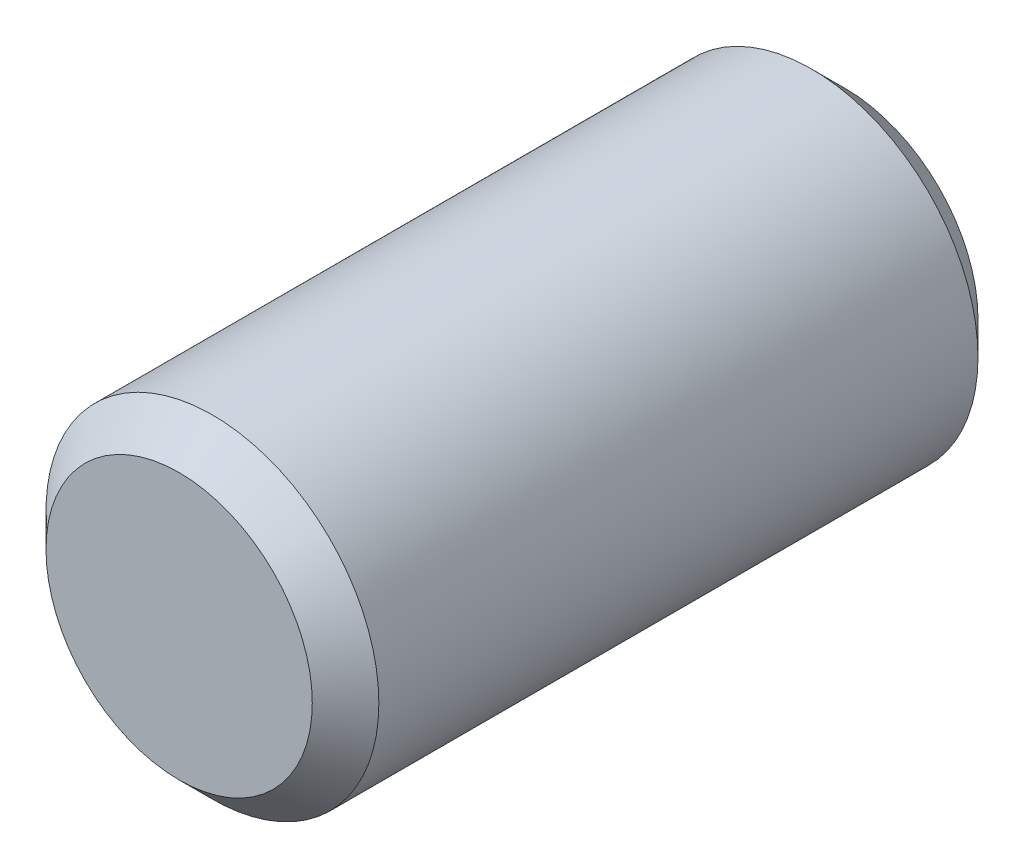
from build123d import *

# Parameters (mm, degrees)
ESQUISSE1_R          = 1
BASE_EXTRUSION_DEPTH = 4
CHANFREIN1_SIZE      = 0.2


with BuildPart() as part:
    # Esquisse1 → Base-Extrusion (new body)
    with BuildSketch(Plane.XY):
        Circle(ESQUISSE1_R)
    extrude(amount=BASE_EXTRUSION_DEPTH)

    # Chanfrein1
    chanfrein1_edges = [part.edges().sort_by_distance(p)[0] for p in [
        (-1, 0, 0),
        (-1, 0, 4),
    ]]
    chamfer(chanfrein1_edges, length=CHANFREIN1_SIZE)


solid = part.part
